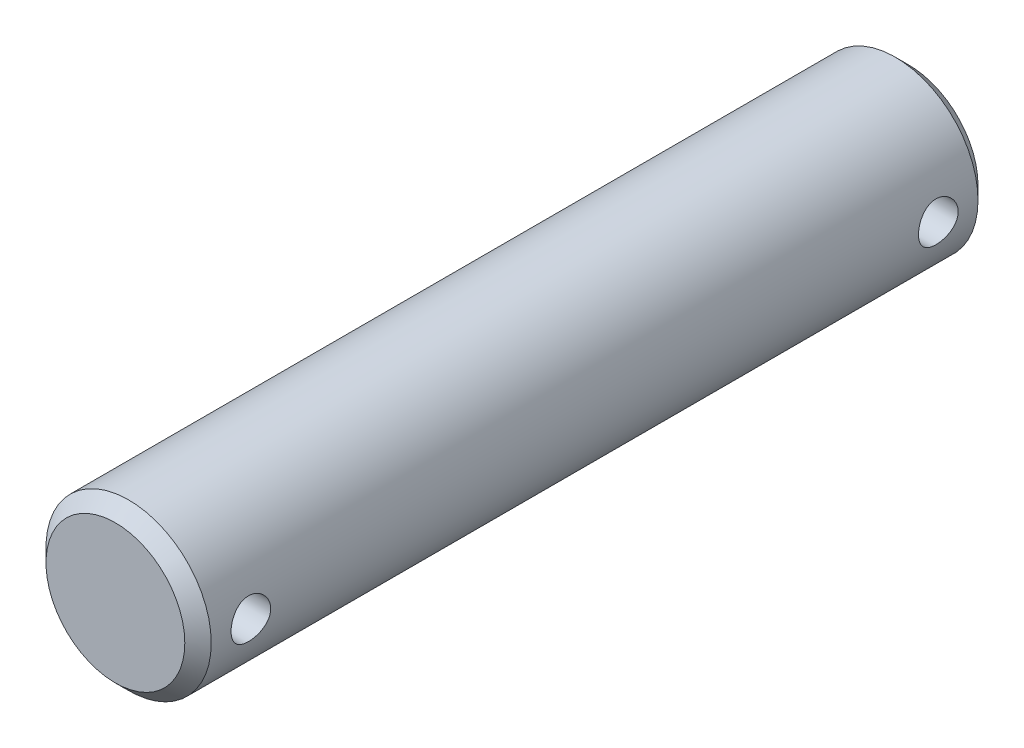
ISO-10303-21;
HEADER;
FILE_DESCRIPTION(('STEP AP214'),'2;1');
FILE_NAME('part.step','',(''),(''),'','','');
FILE_SCHEMA(('AUTOMOTIVE_DESIGN { 1 0 10303 214 1 1 1 1 }'));
ENDSEC;
DATA;
#1=APPLICATION_CONTEXT('core data for automotive mechanical design processes');
#2=APPLICATION_PROTOCOL_DEFINITION('international standard','automotive_design',2000,#1);
#3=PRODUCT_CONTEXT('',#1,'mechanical');
#4=PRODUCT('Part','Part','',(#3));
#5=PRODUCT_RELATED_PRODUCT_CATEGORY('part','',(#4));
#6=PRODUCT_DEFINITION_FORMATION('','',#4);
#7=PRODUCT_DEFINITION_CONTEXT('part definition',#1,'design');
#8=PRODUCT_DEFINITION('design','',#6,#7);
#9=PRODUCT_DEFINITION_SHAPE('','',#8);
#10=(LENGTH_UNIT() NAMED_UNIT(*) SI_UNIT(.MILLI.,.METRE.));
#11=(NAMED_UNIT(*) PLANE_ANGLE_UNIT() SI_UNIT($,.RADIAN.));
#12=(NAMED_UNIT(*) SI_UNIT($,.STERADIAN.) SOLID_ANGLE_UNIT());
#13=UNCERTAINTY_MEASURE_WITH_UNIT(LENGTH_MEASURE(1.E-05),#10,'distance_accuracy_value','');
#14=(GEOMETRIC_REPRESENTATION_CONTEXT(3) GLOBAL_UNCERTAINTY_ASSIGNED_CONTEXT((#13)) GLOBAL_UNIT_ASSIGNED_CONTEXT((#10,
#11,#12)) REPRESENTATION_CONTEXT('',''));
#15=CARTESIAN_POINT('',(0.,0.,0.));
#16=DIRECTION('',(0.,0.,1.));
#17=DIRECTION('',(1.,0.,0.));
#18=AXIS2_PLACEMENT_3D('',#15,#16,#17);
#19=CARTESIAN_POINT('',(0.,0.,120.));
#20=DIRECTION('',(0.,0.,-1.));
#21=DIRECTION('',(-1.,0.,0.));
#22=AXIS2_PLACEMENT_3D('',#19,#20,#21);
#23=CYLINDRICAL_SURFACE('',#22,12.5);
#24=CARTESIAN_POINT('',(-12.5,0.,115.));
#25=CARTESIAN_POINT('',(-12.4999970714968,-0.165963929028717,114.999994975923));
#26=CARTESIAN_POINT('',(-12.4966615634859,-0.331985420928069,114.986181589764));
#27=CARTESIAN_POINT('',(-12.4836783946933,-0.659284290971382,114.931367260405));
#28=CARTESIAN_POINT('',(-12.4740268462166,-0.820558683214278,114.890349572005));
#29=CARTESIAN_POINT('',(-12.4494823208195,-1.13358839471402,114.782507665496));
#30=CARTESIAN_POINT('',(-12.4345953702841,-1.28535442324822,114.715713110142));
#31=CARTESIAN_POINT('',(-12.4011725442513,-1.57552517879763,114.558314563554));
#32=CARTESIAN_POINT('',(-12.3826366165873,-1.71392971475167,114.467710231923));
#33=CARTESIAN_POINT('',(-12.3435386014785,-1.97609263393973,114.263435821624));
#34=CARTESIAN_POINT('',(-12.3229472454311,-2.0995595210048,114.149397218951));
#35=CARTESIAN_POINT('',(-12.2822574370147,-2.32581080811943,113.902281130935));
#36=CARTESIAN_POINT('',(-12.2621590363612,-2.4285930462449,113.769201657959));
#37=CARTESIAN_POINT('',(-12.224437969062,-2.61189993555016,113.485554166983));
#38=CARTESIAN_POINT('',(-12.2068525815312,-2.69210377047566,113.334773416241));
#39=CARTESIAN_POINT('',(-12.1765733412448,-2.82591582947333,113.021380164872));
#40=CARTESIAN_POINT('',(-12.1638787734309,-2.87952794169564,112.858769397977));
#41=CARTESIAN_POINT('',(-12.1451184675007,-2.95765058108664,112.529523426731));
#42=CARTESIAN_POINT('',(-12.1389341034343,-2.98268262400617,112.363018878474));
#43=CARTESIAN_POINT('',(-12.1335389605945,-3.00455808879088,112.028067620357));
#44=CARTESIAN_POINT('',(-12.1343271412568,-3.001405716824,111.859621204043));
#45=CARTESIAN_POINT('',(-12.1426811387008,-2.96741912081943,111.529524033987));
#46=CARTESIAN_POINT('',(-12.1500960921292,-2.93720103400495,111.36780543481));
#47=CARTESIAN_POINT('',(-12.1706283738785,-2.8509214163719,111.051802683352));
#48=CARTESIAN_POINT('',(-12.1837460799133,-2.79485817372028,110.897519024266));
#49=CARTESIAN_POINT('',(-12.2143476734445,-2.65794121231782,110.599087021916));
#50=CARTESIAN_POINT('',(-12.2318714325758,-2.5768594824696,110.455047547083));
#51=CARTESIAN_POINT('',(-12.2692875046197,-2.39236688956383,110.182395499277));
#52=CARTESIAN_POINT('',(-12.2891802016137,-2.28895240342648,110.053785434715));
#53=CARTESIAN_POINT('',(-12.329732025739,-2.05951493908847,109.812106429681));
#54=CARTESIAN_POINT('',(-12.3503975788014,-1.93297064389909,109.699532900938));
#55=CARTESIAN_POINT('',(-12.3896951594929,-1.66255592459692,109.497115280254));
#56=CARTESIAN_POINT('',(-12.4083271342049,-1.51868504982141,109.407271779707));
#57=CARTESIAN_POINT('',(-12.4415394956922,-1.21702847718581,109.252702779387));
#58=CARTESIAN_POINT('',(-12.4561077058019,-1.05920278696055,109.188052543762));
#59=CARTESIAN_POINT('',(-12.4794620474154,-0.73449760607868,109.086334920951));
#60=CARTESIAN_POINT('',(-12.4882491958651,-0.567619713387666,109.049262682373));
#61=CARTESIAN_POINT('',(-12.4989027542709,-0.233787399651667,109.004497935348));
#62=CARTESIAN_POINT('',(-12.5009282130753,-0.0669284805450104,108.996130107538));
#63=CARTESIAN_POINT('',(-12.4982807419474,0.265804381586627,109.007166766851));
#64=CARTESIAN_POINT('',(-12.4936083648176,0.43167840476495,109.026568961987));
#65=CARTESIAN_POINT('',(-12.4781916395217,0.755422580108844,109.092036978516));
#66=CARTESIAN_POINT('',(-12.4675301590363,0.913370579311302,109.137739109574));
#67=CARTESIAN_POINT('',(-12.4413335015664,1.21935330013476,109.254098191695));
#68=CARTESIAN_POINT('',(-12.4257978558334,1.3673870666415,109.324757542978));
#69=CARTESIAN_POINT('',(-12.3911910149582,1.6520615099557,109.490366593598));
#70=CARTESIAN_POINT('',(-12.3720653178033,1.78847176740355,109.585700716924));
#71=CARTESIAN_POINT('',(-12.3324936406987,2.04359904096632,109.797456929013));
#72=CARTESIAN_POINT('',(-12.3120474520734,2.16231325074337,109.913882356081));
#73=CARTESIAN_POINT('',(-12.2715742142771,2.38142453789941,110.167640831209));
#74=CARTESIAN_POINT('',(-12.2515669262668,2.4813497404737,110.305385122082));
#75=CARTESIAN_POINT('',(-12.2147538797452,2.65666020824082,110.596090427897));
#76=CARTESIAN_POINT('',(-12.1979479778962,2.7320465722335,110.749050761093));
#77=CARTESIAN_POINT('',(-12.1696189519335,2.85558993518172,111.065012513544));
#78=CARTESIAN_POINT('',(-12.1580647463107,2.90390754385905,111.227948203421));
#79=CARTESIAN_POINT('',(-12.1415072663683,2.97238380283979,111.559946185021));
#80=CARTESIAN_POINT('',(-12.1365026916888,2.99254804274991,111.729007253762));
#81=CARTESIAN_POINT('',(-12.1337046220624,3.00387066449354,112.063670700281));
#82=CARTESIAN_POINT('',(-12.1357241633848,2.99578106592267,112.229246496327));
#83=CARTESIAN_POINT('',(-12.1463176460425,2.95253345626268,112.556599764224));
#84=CARTESIAN_POINT('',(-12.1548914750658,2.91737590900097,112.718377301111));
#85=CARTESIAN_POINT('',(-12.1775274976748,2.82138591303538,113.032797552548));
#86=CARTESIAN_POINT('',(-12.191561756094,2.76068402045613,113.185482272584));
#87=CARTESIAN_POINT('',(-12.2235433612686,2.61543373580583,113.478604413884));
#88=CARTESIAN_POINT('',(-12.2414912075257,2.53088229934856,113.619040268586));
#89=CARTESIAN_POINT('',(-12.279819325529,2.33793007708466,113.887337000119));
#90=CARTESIAN_POINT('',(-12.3002478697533,2.22900267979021,114.014812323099));
#91=CARTESIAN_POINT('',(-12.3409359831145,1.99143074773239,114.249919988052));
#92=CARTESIAN_POINT('',(-12.361195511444,1.86278158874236,114.35754766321));
#93=CARTESIAN_POINT('',(-12.3996570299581,1.58688299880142,114.551609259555));
#94=CARTESIAN_POINT('',(-12.4178200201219,1.43936414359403,114.637668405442));
#95=CARTESIAN_POINT('',(-12.4496380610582,1.13153622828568,114.783629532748));
#96=CARTESIAN_POINT('',(-12.4632965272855,0.971236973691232,114.843551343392));
#97=CARTESIAN_POINT('',(-12.4824059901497,0.675887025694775,114.926038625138));
#98=CARTESIAN_POINT('',(-12.4889599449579,0.542312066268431,114.953716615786));
#99=CARTESIAN_POINT('',(-12.4977580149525,0.272504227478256,114.990698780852));
#100=CARTESIAN_POINT('',(-12.5000024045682,0.13627151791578,115.000004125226));
#101=CARTESIAN_POINT('',(-12.5,0.,115.));
#102=B_SPLINE_CURVE_WITH_KNOTS('',3,(#24,#25,#26,#27,#28,#29,#30,#31,#32,#33,#34,#35,#36,#37,
#38,#39,#40,#41,#42,#43,#44,#45,#46,#47,#48,#49,#50,#51,#52,#53,#54,#55,#56,#57,#58,#59,#60,#61,
#62,#63,#64,#65,#66,#67,#68,#69,#70,#71,#72,#73,#74,#75,#76,#77,#78,#79,#80,#81,#82,#83,#84,#85,
#86,#87,#88,#89,#90,#91,#92,#93,#94,#95,#96,#97,#98,#99,#100,#101),.UNSPECIFIED.,.T.,.F.,(4,2,2,
2,2,2,2,2,2,2,2,2,2,2,2,2,2,2,2,2,2,2,2,2,2,2,2,2,2,2,2,2,2,2,2,2,2,2,4),(0.,0.497392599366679,
0.995091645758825,1.49221966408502,1.9893547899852,2.49500570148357,3.00070943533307,
3.51327262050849,4.02576083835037,4.52873995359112,5.03164400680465,5.52338274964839,
6.0151540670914,6.51154667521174,7.00801987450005,7.51749958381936,8.02699254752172,
8.53799614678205,9.04890983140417,9.54771776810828,10.0464845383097,10.5385143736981,
11.0305915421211,11.5308523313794,12.0311923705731,12.5427824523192,13.0543496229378,
13.5628484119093,14.0712462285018,14.5662165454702,15.0611783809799,15.5536406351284,
16.0461657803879,16.5505844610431,17.055121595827,17.5678974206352,18.0802835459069,
18.4887142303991,18.8971189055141),.UNSPECIFIED.);
#103=CARTESIAN_POINT('',(-12.5,0.,115.));
#104=VERTEX_POINT('',#103);
#105=EDGE_CURVE('E31',#104,#104,#102,.T.);
#106=ORIENTED_EDGE('',*,*,#105,.T.);
#107=EDGE_LOOP('',(#106));
#108=FACE_BOUND('',#107,.T.);
#109=CARTESIAN_POINT('',(12.5,0.,109.));
#110=CARTESIAN_POINT('',(12.4999970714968,-0.165963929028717,109.000005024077));
#111=CARTESIAN_POINT('',(12.4966615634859,-0.331985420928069,109.013818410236));
#112=CARTESIAN_POINT('',(12.4836783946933,-0.659284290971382,109.068632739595));
#113=CARTESIAN_POINT('',(12.4740268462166,-0.820558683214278,109.109650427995));
#114=CARTESIAN_POINT('',(12.4494823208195,-1.13358839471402,109.217492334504));
#115=CARTESIAN_POINT('',(12.4345953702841,-1.28535442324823,109.284286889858));
#116=CARTESIAN_POINT('',(12.4011725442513,-1.57552517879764,109.441685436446));
#117=CARTESIAN_POINT('',(12.3826366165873,-1.71392971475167,109.532289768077));
#118=CARTESIAN_POINT('',(12.3435386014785,-1.97609263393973,109.736564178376));
#119=CARTESIAN_POINT('',(12.3229472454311,-2.09955952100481,109.850602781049));
#120=CARTESIAN_POINT('',(12.2822574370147,-2.32581080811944,110.097718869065));
#121=CARTESIAN_POINT('',(12.2621590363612,-2.4285930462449,110.230798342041));
#122=CARTESIAN_POINT('',(12.224437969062,-2.61189993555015,110.514445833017));
#123=CARTESIAN_POINT('',(12.2068525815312,-2.69210377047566,110.665226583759));
#124=CARTESIAN_POINT('',(12.1765733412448,-2.82591582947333,110.978619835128));
#125=CARTESIAN_POINT('',(12.1638787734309,-2.87952794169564,111.141230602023));
#126=CARTESIAN_POINT('',(12.1451184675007,-2.95765058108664,111.470476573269));
#127=CARTESIAN_POINT('',(12.1389341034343,-2.98268262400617,111.636981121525));
#128=CARTESIAN_POINT('',(12.1335389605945,-3.00455808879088,111.971932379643));
#129=CARTESIAN_POINT('',(12.1343271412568,-3.001405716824,112.140378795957));
#130=CARTESIAN_POINT('',(12.1426811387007,-2.96741912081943,112.470475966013));
#131=CARTESIAN_POINT('',(12.1500960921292,-2.93720103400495,112.63219456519));
#132=CARTESIAN_POINT('',(12.1706283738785,-2.85092141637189,112.948197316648));
#133=CARTESIAN_POINT('',(12.1837460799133,-2.79485817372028,113.102480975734));
#134=CARTESIAN_POINT('',(12.2143476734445,-2.65794121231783,113.400912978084));
#135=CARTESIAN_POINT('',(12.2318714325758,-2.57685948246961,113.544952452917));
#136=CARTESIAN_POINT('',(12.2692875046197,-2.39236688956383,113.817604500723));
#137=CARTESIAN_POINT('',(12.2891802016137,-2.28895240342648,113.946214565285));
#138=CARTESIAN_POINT('',(12.329732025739,-2.05951493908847,114.187893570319));
#139=CARTESIAN_POINT('',(12.3503975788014,-1.93297064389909,114.300467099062));
#140=CARTESIAN_POINT('',(12.3896951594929,-1.66255592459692,114.502884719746));
#141=CARTESIAN_POINT('',(12.4083271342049,-1.51868504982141,114.592728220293));
#142=CARTESIAN_POINT('',(12.4415394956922,-1.21702847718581,114.747297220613));
#143=CARTESIAN_POINT('',(12.4561077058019,-1.05920278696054,114.811947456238));
#144=CARTESIAN_POINT('',(12.4794620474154,-0.734497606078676,114.913665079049));
#145=CARTESIAN_POINT('',(12.4882491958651,-0.567619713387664,114.950737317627));
#146=CARTESIAN_POINT('',(12.4989027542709,-0.233787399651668,114.995502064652));
#147=CARTESIAN_POINT('',(12.5009282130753,-0.0669284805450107,115.003869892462));
#148=CARTESIAN_POINT('',(12.4982807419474,0.265804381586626,114.992833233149));
#149=CARTESIAN_POINT('',(12.4936083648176,0.43167840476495,114.973431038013));
#150=CARTESIAN_POINT('',(12.4781916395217,0.755422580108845,114.907963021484));
#151=CARTESIAN_POINT('',(12.4675301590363,0.913370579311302,114.862260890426));
#152=CARTESIAN_POINT('',(12.4413335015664,1.21935330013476,114.745901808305));
#153=CARTESIAN_POINT('',(12.4257978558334,1.3673870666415,114.675242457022));
#154=CARTESIAN_POINT('',(12.3911910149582,1.6520615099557,114.509633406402));
#155=CARTESIAN_POINT('',(12.3720653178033,1.78847176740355,114.414299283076));
#156=CARTESIAN_POINT('',(12.3324936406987,2.04359904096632,114.202543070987));
#157=CARTESIAN_POINT('',(12.3120474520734,2.16231325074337,114.086117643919));
#158=CARTESIAN_POINT('',(12.2715742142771,2.38142453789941,113.832359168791));
#159=CARTESIAN_POINT('',(12.2515669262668,2.48134974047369,113.694614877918));
#160=CARTESIAN_POINT('',(12.2147538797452,2.65666020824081,113.403909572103));
#161=CARTESIAN_POINT('',(12.1979479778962,2.7320465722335,113.250949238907));
#162=CARTESIAN_POINT('',(12.1696189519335,2.85558993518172,112.934987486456));
#163=CARTESIAN_POINT('',(12.1580647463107,2.90390754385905,112.772051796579));
#164=CARTESIAN_POINT('',(12.1415072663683,2.97238380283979,112.440053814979));
#165=CARTESIAN_POINT('',(12.1365026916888,2.99254804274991,112.270992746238));
#166=CARTESIAN_POINT('',(12.1337046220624,3.00387066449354,111.936329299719));
#167=CARTESIAN_POINT('',(12.1357241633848,2.99578106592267,111.770753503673));
#168=CARTESIAN_POINT('',(12.1463176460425,2.95253345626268,111.443400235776));
#169=CARTESIAN_POINT('',(12.1548914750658,2.91737590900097,111.281622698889));
#170=CARTESIAN_POINT('',(12.1775274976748,2.82138591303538,110.967202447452));
#171=CARTESIAN_POINT('',(12.191561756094,2.76068402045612,110.814517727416));
#172=CARTESIAN_POINT('',(12.2235433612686,2.61543373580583,110.521395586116));
#173=CARTESIAN_POINT('',(12.2414912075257,2.53088229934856,110.380959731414));
#174=CARTESIAN_POINT('',(12.279819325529,2.33793007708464,110.11266299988));
#175=CARTESIAN_POINT('',(12.3002478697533,2.22900267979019,109.985187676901));
#176=CARTESIAN_POINT('',(12.3409359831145,1.99143074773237,109.750080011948));
#177=CARTESIAN_POINT('',(12.361195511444,1.86278158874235,109.64245233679));
#178=CARTESIAN_POINT('',(12.3996570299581,1.58688299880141,109.448390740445));
#179=CARTESIAN_POINT('',(12.4178200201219,1.43936414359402,109.362331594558));
#180=CARTESIAN_POINT('',(12.4496380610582,1.13153622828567,109.216370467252));
#181=CARTESIAN_POINT('',(12.4632965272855,0.971236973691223,109.156448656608));
#182=CARTESIAN_POINT('',(12.4824059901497,0.675887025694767,109.073961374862));
#183=CARTESIAN_POINT('',(12.4889599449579,0.542312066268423,109.046283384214));
#184=CARTESIAN_POINT('',(12.4977580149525,0.272504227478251,109.009301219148));
#185=CARTESIAN_POINT('',(12.5000024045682,0.136271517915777,108.999995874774));
#186=CARTESIAN_POINT('',(12.5,0.,109.));
#187=B_SPLINE_CURVE_WITH_KNOTS('',3,(#109,#110,#111,#112,#113,#114,#115,#116,#117,#118,#119,
#120,#121,#122,#123,#124,#125,#126,#127,#128,#129,#130,#131,#132,#133,#134,#135,#136,#137,#138,
#139,#140,#141,#142,#143,#144,#145,#146,#147,#148,#149,#150,#151,#152,#153,#154,#155,#156,#157,
#158,#159,#160,#161,#162,#163,#164,#165,#166,#167,#168,#169,#170,#171,#172,#173,#174,#175,#176,
#177,#178,#179,#180,#181,#182,#183,#184,#185,#186),.UNSPECIFIED.,.T.,.F.,(4,2,2,2,2,2,2,2,2,2,2,
2,2,2,2,2,2,2,2,2,2,2,2,2,2,2,2,2,2,2,2,2,2,2,2,2,2,2,4),(0.,0.497392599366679,
0.995091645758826,1.49221966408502,1.9893547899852,2.49500570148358,3.00070943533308,
3.51327262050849,4.02576083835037,4.52873995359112,5.03164400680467,5.5233827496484,
6.0151540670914,6.51154667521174,7.00801987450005,7.51749958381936,8.02699254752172,
8.53799614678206,9.04890983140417,9.54771776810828,10.0464845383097,10.5385143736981,
11.0305915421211,11.5308523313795,12.0311923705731,12.5427824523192,13.0543496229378,
13.5628484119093,14.0712462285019,14.5662165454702,15.06117838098,15.5536406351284,
16.0461657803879,16.5505844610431,17.055121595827,17.5678974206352,18.0802835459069,
18.4887142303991,18.8971189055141),.UNSPECIFIED.);
#188=CARTESIAN_POINT('',(12.5,0.,109.));
#189=VERTEX_POINT('',#188);
#190=EDGE_CURVE('E89',#189,#189,#187,.T.);
#191=ORIENTED_EDGE('',*,*,#190,.T.);
#192=EDGE_LOOP('',(#191));
#193=FACE_BOUND('',#192,.T.);
#194=CARTESIAN_POINT('',(-12.5,0.,11.));
#195=CARTESIAN_POINT('',(-12.4999970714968,-0.165963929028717,10.9999949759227));
#196=CARTESIAN_POINT('',(-12.4966615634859,-0.331985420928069,10.9861815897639));
#197=CARTESIAN_POINT('',(-12.4836783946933,-0.659284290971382,10.9313672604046));
#198=CARTESIAN_POINT('',(-12.4740268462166,-0.820558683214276,10.8903495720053));
#199=CARTESIAN_POINT('',(-12.4494823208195,-1.13358839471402,10.7825076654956));
#200=CARTESIAN_POINT('',(-12.4345953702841,-1.28535442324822,10.7157131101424));
#201=CARTESIAN_POINT('',(-12.4011725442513,-1.57552517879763,10.5583145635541));
#202=CARTESIAN_POINT('',(-12.3826366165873,-1.71392971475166,10.4677102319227));
#203=CARTESIAN_POINT('',(-12.3435386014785,-1.97609263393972,10.2634358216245));
#204=CARTESIAN_POINT('',(-12.3229472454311,-2.0995595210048,10.1493972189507));
#205=CARTESIAN_POINT('',(-12.2822574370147,-2.32581080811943,9.90228113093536));
#206=CARTESIAN_POINT('',(-12.2621590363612,-2.42859304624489,9.76920165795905));
#207=CARTESIAN_POINT('',(-12.224437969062,-2.61189993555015,9.48555416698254));
#208=CARTESIAN_POINT('',(-12.2068525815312,-2.69210377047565,9.33477341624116));
#209=CARTESIAN_POINT('',(-12.1765733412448,-2.82591582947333,9.02138016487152));
#210=CARTESIAN_POINT('',(-12.1638787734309,-2.87952794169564,8.85876939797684));
#211=CARTESIAN_POINT('',(-12.1451184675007,-2.95765058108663,8.5295234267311));
#212=CARTESIAN_POINT('',(-12.1389341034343,-2.98268262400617,8.3630188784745));
#213=CARTESIAN_POINT('',(-12.1335389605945,-3.00455808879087,8.02806762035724));
#214=CARTESIAN_POINT('',(-12.1343271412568,-3.00140571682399,7.85962120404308));
#215=CARTESIAN_POINT('',(-12.1426811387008,-2.96741912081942,7.52952403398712));
#216=CARTESIAN_POINT('',(-12.1500960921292,-2.93720103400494,7.36780543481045));
#217=CARTESIAN_POINT('',(-12.1706283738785,-2.85092141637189,7.05180268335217));
#218=CARTESIAN_POINT('',(-12.1837460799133,-2.79485817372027,6.89751902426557));
#219=CARTESIAN_POINT('',(-12.2143476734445,-2.65794121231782,6.59908702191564));
#220=CARTESIAN_POINT('',(-12.2318714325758,-2.5768594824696,6.45504754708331));
#221=CARTESIAN_POINT('',(-12.2692875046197,-2.39236688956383,6.18239549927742));
#222=CARTESIAN_POINT('',(-12.2891802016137,-2.28895240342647,6.05378543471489));
#223=CARTESIAN_POINT('',(-12.329732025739,-2.05951493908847,5.81210642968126));
#224=CARTESIAN_POINT('',(-12.3503975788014,-1.93297064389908,5.69953290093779));
#225=CARTESIAN_POINT('',(-12.3896951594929,-1.66255592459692,5.49711528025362));
#226=CARTESIAN_POINT('',(-12.4083271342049,-1.51868504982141,5.40727177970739));
#227=CARTESIAN_POINT('',(-12.4415394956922,-1.21702847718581,5.25270277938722));
#228=CARTESIAN_POINT('',(-12.4561077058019,-1.05920278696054,5.18805254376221));
#229=CARTESIAN_POINT('',(-12.4794620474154,-0.734497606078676,5.08633492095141));
#230=CARTESIAN_POINT('',(-12.4882491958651,-0.567619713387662,5.04926268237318));
#231=CARTESIAN_POINT('',(-12.4989027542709,-0.233787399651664,5.00449793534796));
#232=CARTESIAN_POINT('',(-12.5009282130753,-0.0669284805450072,4.99613010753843));
#233=CARTESIAN_POINT('',(-12.4982807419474,0.26580438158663,5.0071667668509));
#234=CARTESIAN_POINT('',(-12.4936083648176,0.431678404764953,5.02656896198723));
#235=CARTESIAN_POINT('',(-12.4781916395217,0.755422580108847,5.09203697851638));
#236=CARTESIAN_POINT('',(-12.4675301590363,0.913370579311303,5.1377391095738));
#237=CARTESIAN_POINT('',(-12.4413335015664,1.21935330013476,5.25409819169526));
#238=CARTESIAN_POINT('',(-12.4257978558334,1.3673870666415,5.3247575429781));
#239=CARTESIAN_POINT('',(-12.3911910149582,1.6520615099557,5.49036659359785));
#240=CARTESIAN_POINT('',(-12.3720653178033,1.78847176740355,5.58570071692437));
#241=CARTESIAN_POINT('',(-12.3324936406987,2.04359904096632,5.79745692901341));
#242=CARTESIAN_POINT('',(-12.3120474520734,2.16231325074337,5.91388235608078));
#243=CARTESIAN_POINT('',(-12.2715742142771,2.38142453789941,6.16764083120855));
#244=CARTESIAN_POINT('',(-12.2515669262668,2.4813497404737,6.3053851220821));
#245=CARTESIAN_POINT('',(-12.2147538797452,2.65666020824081,6.59609042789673));
#246=CARTESIAN_POINT('',(-12.1979479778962,2.7320465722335,6.74905076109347));
#247=CARTESIAN_POINT('',(-12.1696189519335,2.85558993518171,7.06501251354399));
#248=CARTESIAN_POINT('',(-12.1580647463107,2.90390754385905,7.22794820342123));
#249=CARTESIAN_POINT('',(-12.1415072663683,2.97238380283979,7.55994618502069));
#250=CARTESIAN_POINT('',(-12.1365026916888,2.99254804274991,7.72900725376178));
#251=CARTESIAN_POINT('',(-12.1337046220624,3.00387066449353,8.0636707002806));
#252=CARTESIAN_POINT('',(-12.1357241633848,2.99578106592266,8.2292464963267));
#253=CARTESIAN_POINT('',(-12.1463176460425,2.95253345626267,8.55659976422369));
#254=CARTESIAN_POINT('',(-12.1548914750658,2.91737590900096,8.71837730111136));
#255=CARTESIAN_POINT('',(-12.1775274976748,2.82138591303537,9.03279755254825));
#256=CARTESIAN_POINT('',(-12.191561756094,2.76068402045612,9.18548227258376));
#257=CARTESIAN_POINT('',(-12.2235433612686,2.61543373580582,9.47860441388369));
#258=CARTESIAN_POINT('',(-12.2414912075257,2.53088229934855,9.61904026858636));
#259=CARTESIAN_POINT('',(-12.279819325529,2.33793007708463,9.88733700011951));
#260=CARTESIAN_POINT('',(-12.3002478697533,2.22900267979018,10.0148123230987));
#261=CARTESIAN_POINT('',(-12.3409359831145,1.99143074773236,10.2499199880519));
#262=CARTESIAN_POINT('',(-12.361195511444,1.86278158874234,10.3575476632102));
#263=CARTESIAN_POINT('',(-12.3996570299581,1.5868829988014,10.5516092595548));
#264=CARTESIAN_POINT('',(-12.4178200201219,1.43936414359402,10.637668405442));
#265=CARTESIAN_POINT('',(-12.4496380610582,1.13153622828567,10.7836295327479));
#266=CARTESIAN_POINT('',(-12.4632965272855,0.97123697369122,10.8435513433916));
#267=CARTESIAN_POINT('',(-12.4824059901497,0.675887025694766,10.9260386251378));
#268=CARTESIAN_POINT('',(-12.4889599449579,0.542312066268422,10.9537166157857));
#269=CARTESIAN_POINT('',(-12.4977580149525,0.272504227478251,10.9906987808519));
#270=CARTESIAN_POINT('',(-12.5000024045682,0.136271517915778,11.0000041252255));
#271=CARTESIAN_POINT('',(-12.5,0.,11.));
#272=B_SPLINE_CURVE_WITH_KNOTS('',3,(#194,#195,#196,#197,#198,#199,#200,#201,#202,#203,#204,
#205,#206,#207,#208,#209,#210,#211,#212,#213,#214,#215,#216,#217,#218,#219,#220,#221,#222,#223,
#224,#225,#226,#227,#228,#229,#230,#231,#232,#233,#234,#235,#236,#237,#238,#239,#240,#241,#242,
#243,#244,#245,#246,#247,#248,#249,#250,#251,#252,#253,#254,#255,#256,#257,#258,#259,#260,#261,
#262,#263,#264,#265,#266,#267,#268,#269,#270,#271),.UNSPECIFIED.,.T.,.F.,(4,2,2,2,2,2,2,2,2,2,2,
2,2,2,2,2,2,2,2,2,2,2,2,2,2,2,2,2,2,2,2,2,2,2,2,2,2,2,4),(0.,0.497392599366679,
0.995091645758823,1.49221966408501,1.98935478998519,2.49500570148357,3.00070943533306,
3.51327262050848,4.02576083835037,4.52873995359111,5.03164400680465,5.52338274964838,
6.01515406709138,6.51154667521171,7.00801987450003,7.51749958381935,8.02699254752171,
8.53799614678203,9.04890983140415,9.54771776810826,10.0464845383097,10.5385143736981,
11.0305915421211,11.5308523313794,12.031192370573,12.5427824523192,13.0543496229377,
13.5628484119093,14.0712462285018,14.5662165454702,15.0611783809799,15.5536406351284,
16.0461657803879,16.5505844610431,17.0551215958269,17.5678974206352,18.0802835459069,
18.4887142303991,18.897118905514),.UNSPECIFIED.);
#273=CARTESIAN_POINT('',(-12.5,0.,11.));
#274=VERTEX_POINT('',#273);
#275=EDGE_CURVE('E53',#274,#274,#272,.T.);
#276=ORIENTED_EDGE('',*,*,#275,.T.);
#277=EDGE_LOOP('',(#276));
#278=FACE_BOUND('',#277,.T.);
#279=CARTESIAN_POINT('',(12.5,0.,5.));
#280=CARTESIAN_POINT('',(12.4999970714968,-0.165963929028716,5.00000502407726));
#281=CARTESIAN_POINT('',(12.4966615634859,-0.331985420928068,5.01381841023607));
#282=CARTESIAN_POINT('',(12.4836783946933,-0.659284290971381,5.06863273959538));
#283=CARTESIAN_POINT('',(12.4740268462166,-0.820558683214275,5.10965042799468));
#284=CARTESIAN_POINT('',(12.4494823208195,-1.13358839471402,5.21749233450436));
#285=CARTESIAN_POINT('',(12.4345953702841,-1.28535442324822,5.28428688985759));
#286=CARTESIAN_POINT('',(12.4011725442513,-1.57552517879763,5.44168543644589));
#287=CARTESIAN_POINT('',(12.3826366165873,-1.71392971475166,5.53228976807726));
#288=CARTESIAN_POINT('',(12.3435386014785,-1.97609263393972,5.73656417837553));
#289=CARTESIAN_POINT('',(12.3229472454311,-2.0995595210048,5.85060278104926));
#290=CARTESIAN_POINT('',(12.2822574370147,-2.32581080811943,6.09771886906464));
#291=CARTESIAN_POINT('',(12.2621590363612,-2.42859304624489,6.23079834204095));
#292=CARTESIAN_POINT('',(12.224437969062,-2.61189993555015,6.51444583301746));
#293=CARTESIAN_POINT('',(12.2068525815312,-2.69210377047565,6.66522658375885));
#294=CARTESIAN_POINT('',(12.1765733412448,-2.82591582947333,6.97861983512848));
#295=CARTESIAN_POINT('',(12.1638787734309,-2.87952794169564,7.14123060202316));
#296=CARTESIAN_POINT('',(12.1451184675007,-2.95765058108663,7.4704765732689));
#297=CARTESIAN_POINT('',(12.1389341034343,-2.98268262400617,7.63698112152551));
#298=CARTESIAN_POINT('',(12.1335389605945,-3.00455808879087,7.97193237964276));
#299=CARTESIAN_POINT('',(12.1343271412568,-3.00140571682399,8.14037879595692));
#300=CARTESIAN_POINT('',(12.1426811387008,-2.96741912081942,8.47047596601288));
#301=CARTESIAN_POINT('',(12.1500960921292,-2.93720103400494,8.63219456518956));
#302=CARTESIAN_POINT('',(12.1706283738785,-2.85092141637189,8.94819731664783));
#303=CARTESIAN_POINT('',(12.1837460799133,-2.79485817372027,9.10248097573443));
#304=CARTESIAN_POINT('',(12.2143476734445,-2.65794121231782,9.40091297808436));
#305=CARTESIAN_POINT('',(12.2318714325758,-2.5768594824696,9.54495245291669));
#306=CARTESIAN_POINT('',(12.2692875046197,-2.39236688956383,9.81760450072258));
#307=CARTESIAN_POINT('',(12.2891802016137,-2.28895240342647,9.94621456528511));
#308=CARTESIAN_POINT('',(12.329732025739,-2.05951493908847,10.1878935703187));
#309=CARTESIAN_POINT('',(12.3503975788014,-1.93297064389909,10.3004670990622));
#310=CARTESIAN_POINT('',(12.3896951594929,-1.66255592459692,10.5028847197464));
#311=CARTESIAN_POINT('',(12.4083271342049,-1.51868504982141,10.5927282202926));
#312=CARTESIAN_POINT('',(12.4415394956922,-1.21702847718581,10.7472972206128));
#313=CARTESIAN_POINT('',(12.4561077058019,-1.05920278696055,10.8119474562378));
#314=CARTESIAN_POINT('',(12.4794620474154,-0.734497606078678,10.9136650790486));
#315=CARTESIAN_POINT('',(12.4882491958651,-0.567619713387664,10.9507373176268));
#316=CARTESIAN_POINT('',(12.4989027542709,-0.233787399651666,10.995502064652));
#317=CARTESIAN_POINT('',(12.5009282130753,-0.0669284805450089,11.0038698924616));
#318=CARTESIAN_POINT('',(12.4982807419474,0.265804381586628,10.9928332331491));
#319=CARTESIAN_POINT('',(12.4936083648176,0.431678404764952,10.9734310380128));
#320=CARTESIAN_POINT('',(12.4781916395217,0.755422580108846,10.9079630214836));
#321=CARTESIAN_POINT('',(12.4675301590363,0.913370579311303,10.8622608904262));
#322=CARTESIAN_POINT('',(12.4413335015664,1.21935330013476,10.7459018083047));
#323=CARTESIAN_POINT('',(12.4257978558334,1.3673870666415,10.6752424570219));
#324=CARTESIAN_POINT('',(12.3911910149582,1.6520615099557,10.5096334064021));
#325=CARTESIAN_POINT('',(12.3720653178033,1.78847176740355,10.4142992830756));
#326=CARTESIAN_POINT('',(12.3324936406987,2.04359904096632,10.2025430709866));
#327=CARTESIAN_POINT('',(12.3120474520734,2.16231325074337,10.0861176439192));
#328=CARTESIAN_POINT('',(12.2715742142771,2.38142453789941,9.83235916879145));
#329=CARTESIAN_POINT('',(12.2515669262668,2.4813497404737,9.6946148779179));
#330=CARTESIAN_POINT('',(12.2147538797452,2.65666020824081,9.40390957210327));
#331=CARTESIAN_POINT('',(12.1979479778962,2.7320465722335,9.25094923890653));
#332=CARTESIAN_POINT('',(12.1696189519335,2.85558993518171,8.93498748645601));
#333=CARTESIAN_POINT('',(12.1580647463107,2.90390754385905,8.77205179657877));
#334=CARTESIAN_POINT('',(12.1415072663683,2.97238380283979,8.44005381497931));
#335=CARTESIAN_POINT('',(12.1365026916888,2.99254804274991,8.27099274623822));
#336=CARTESIAN_POINT('',(12.1337046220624,3.00387066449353,7.9363292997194));
#337=CARTESIAN_POINT('',(12.1357241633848,2.99578106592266,7.7707535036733));
#338=CARTESIAN_POINT('',(12.1463176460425,2.95253345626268,7.44340023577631));
#339=CARTESIAN_POINT('',(12.1548914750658,2.91737590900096,7.28162269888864));
#340=CARTESIAN_POINT('',(12.1775274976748,2.82138591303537,6.96720244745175));
#341=CARTESIAN_POINT('',(12.191561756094,2.76068402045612,6.81451772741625));
#342=CARTESIAN_POINT('',(12.2235433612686,2.61543373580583,6.52139558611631));
#343=CARTESIAN_POINT('',(12.2414912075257,2.53088229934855,6.38095973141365));
#344=CARTESIAN_POINT('',(12.279819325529,2.33793007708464,6.11266299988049));
#345=CARTESIAN_POINT('',(12.3002478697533,2.22900267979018,5.98518767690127));
#346=CARTESIAN_POINT('',(12.3409359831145,1.99143074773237,5.75008001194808));
#347=CARTESIAN_POINT('',(12.361195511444,1.86278158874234,5.64245233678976));
#348=CARTESIAN_POINT('',(12.3996570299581,1.5868829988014,5.44839074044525));
#349=CARTESIAN_POINT('',(12.4178200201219,1.43936414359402,5.362331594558));
#350=CARTESIAN_POINT('',(12.4496380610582,1.13153622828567,5.21637046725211));
#351=CARTESIAN_POINT('',(12.4632965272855,0.971236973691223,5.15644865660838));
#352=CARTESIAN_POINT('',(12.4824059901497,0.675887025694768,5.07396137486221));
#353=CARTESIAN_POINT('',(12.4889599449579,0.542312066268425,5.0462833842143));
#354=CARTESIAN_POINT('',(12.4977580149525,0.272504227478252,5.00930121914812));
#355=CARTESIAN_POINT('',(12.5000024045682,0.136271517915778,4.99999587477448));
#356=CARTESIAN_POINT('',(12.5,0.,5.));
#357=B_SPLINE_CURVE_WITH_KNOTS('',3,(#279,#280,#281,#282,#283,#284,#285,#286,#287,#288,#289,
#290,#291,#292,#293,#294,#295,#296,#297,#298,#299,#300,#301,#302,#303,#304,#305,#306,#307,#308,
#309,#310,#311,#312,#313,#314,#315,#316,#317,#318,#319,#320,#321,#322,#323,#324,#325,#326,#327,
#328,#329,#330,#331,#332,#333,#334,#335,#336,#337,#338,#339,#340,#341,#342,#343,#344,#345,#346,
#347,#348,#349,#350,#351,#352,#353,#354,#355,#356),.UNSPECIFIED.,.T.,.F.,(4,2,2,2,2,2,2,2,2,2,2,
2,2,2,2,2,2,2,2,2,2,2,2,2,2,2,2,2,2,2,2,2,2,2,2,2,2,2,4),(0.,0.497392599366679,
0.995091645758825,1.49221966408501,1.98935478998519,2.49500570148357,3.00070943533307,
3.51327262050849,4.02576083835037,4.52873995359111,5.03164400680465,5.52338274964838,
6.01515406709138,6.51154667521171,7.00801987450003,7.51749958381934,8.0269925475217,
8.53799614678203,9.04890983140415,9.54771776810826,10.0464845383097,10.5385143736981,
11.0305915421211,11.5308523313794,12.031192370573,12.5427824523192,13.0543496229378,
13.5628484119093,14.0712462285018,14.5662165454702,15.0611783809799,15.5536406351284,
16.0461657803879,16.5505844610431,17.0551215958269,17.5678974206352,18.0802835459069,
18.4887142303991,18.897118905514),.UNSPECIFIED.);
#358=CARTESIAN_POINT('',(12.5,0.,5.));
#359=VERTEX_POINT('',#358);
#360=EDGE_CURVE('E47',#359,#359,#357,.T.);
#361=ORIENTED_EDGE('',*,*,#360,.T.);
#362=EDGE_LOOP('',(#361));
#363=FACE_BOUND('',#362,.T.);
#364=CARTESIAN_POINT('',(0.,0.,2.));
#365=DIRECTION('',(0.,0.,1.));
#366=DIRECTION('',(1.,0.,0.));
#367=AXIS2_PLACEMENT_3D('',#364,#365,#366);
#368=CIRCLE('',#367,12.5);
#369=CARTESIAN_POINT('',(12.5,0.,2.));
#370=VERTEX_POINT('',#369);
#371=EDGE_CURVE('E43',#370,#370,#368,.T.);
#372=ORIENTED_EDGE('',*,*,#371,.T.);
#373=EDGE_LOOP('',(#372));
#374=FACE_BOUND('',#373,.T.);
#375=CARTESIAN_POINT('',(0.,0.,118.));
#376=DIRECTION('',(0.,0.,1.));
#377=DIRECTION('',(1.,0.,0.));
#378=AXIS2_PLACEMENT_3D('',#375,#376,#377);
#379=CIRCLE('',#378,12.5);
#380=CARTESIAN_POINT('',(12.5,0.,118.));
#381=VERTEX_POINT('',#380);
#382=EDGE_CURVE('E100',#381,#381,#379,.F.);
#383=ORIENTED_EDGE('',*,*,#382,.T.);
#384=EDGE_LOOP('',(#383));
#385=FACE_BOUND('',#384,.T.);
#386=ADVANCED_FACE('F27',(#108,#193,#278,#363,#374,#385),#23,.T.);
#387=CARTESIAN_POINT('',(0.,0.,120.));
#388=DIRECTION('',(0.,0.,1.));
#389=DIRECTION('',(1.,0.,0.));
#390=AXIS2_PLACEMENT_3D('',#387,#388,#389);
#391=PLANE('',#390);
#392=CARTESIAN_POINT('',(0.,0.,120.));
#393=DIRECTION('',(0.,0.,1.));
#394=DIRECTION('',(1.,0.,0.));
#395=AXIS2_PLACEMENT_3D('',#392,#393,#394);
#396=CIRCLE('',#395,10.5);
#397=CARTESIAN_POINT('',(10.5,0.,120.));
#398=VERTEX_POINT('',#397);
#399=EDGE_CURVE('E10',#398,#398,#396,.T.);
#400=ORIENTED_EDGE('',*,*,#399,.T.);
#401=EDGE_LOOP('',(#400));
#402=FACE_BOUND('',#401,.T.);
#403=ADVANCED_FACE('F74',(#402),#391,.T.);
#404=CARTESIAN_POINT('',(0.,0.,0.));
#405=DIRECTION('',(0.,0.,1.));
#406=DIRECTION('',(1.,0.,0.));
#407=AXIS2_PLACEMENT_3D('',#404,#405,#406);
#408=PLANE('',#407);
#409=CARTESIAN_POINT('',(0.,0.,0.));
#410=DIRECTION('',(0.,0.,1.));
#411=DIRECTION('',(1.,0.,0.));
#412=AXIS2_PLACEMENT_3D('',#409,#410,#411);
#413=CIRCLE('',#412,10.5);
#414=CARTESIAN_POINT('',(10.5,0.,0.));
#415=VERTEX_POINT('',#414);
#416=EDGE_CURVE('E38',#415,#415,#413,.F.);
#417=ORIENTED_EDGE('',*,*,#416,.T.);
#418=EDGE_LOOP('',(#417));
#419=FACE_BOUND('',#418,.T.);
#420=ADVANCED_FACE('F71',(#419),#408,.F.);
#421=CARTESIAN_POINT('',(0.,0.,2.));
#422=DIRECTION('',(0.,0.,1.));
#423=DIRECTION('',(1.,0.,0.));
#424=AXIS2_PLACEMENT_3D('',#421,#422,#423);
#425=CONICAL_SURFACE('',#424,12.5,0.785398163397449);
#426=ORIENTED_EDGE('',*,*,#416,.F.);
#427=EDGE_LOOP('',(#426));
#428=FACE_BOUND('',#427,.T.);
#429=ORIENTED_EDGE('',*,*,#371,.F.);
#430=EDGE_LOOP('',(#429));
#431=FACE_BOUND('',#430,.T.);
#432=ADVANCED_FACE('F67',(#428,#431),#425,.T.);
#433=CARTESIAN_POINT('',(0.,0.,120.));
#434=DIRECTION('',(0.,0.,-1.));
#435=DIRECTION('',(-1.,0.,0.));
#436=AXIS2_PLACEMENT_3D('',#433,#434,#435);
#437=CONICAL_SURFACE('',#436,10.5,0.785398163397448);
#438=ORIENTED_EDGE('',*,*,#382,.F.);
#439=EDGE_LOOP('',(#438));
#440=FACE_BOUND('',#439,.T.);
#441=ORIENTED_EDGE('',*,*,#399,.F.);
#442=EDGE_LOOP('',(#441));
#443=FACE_BOUND('',#442,.T.);
#444=ADVANCED_FACE('F61',(#440,#443),#437,.T.);
#445=CARTESIAN_POINT('',(-14.,0.,8.));
#446=DIRECTION('',(1.,0.,0.));
#447=DIRECTION('',(0.,0.,-1.));
#448=AXIS2_PLACEMENT_3D('',#445,#446,#447);
#449=CYLINDRICAL_SURFACE('',#448,3.);
#450=ORIENTED_EDGE('',*,*,#360,.F.);
#451=EDGE_LOOP('',(#450));
#452=FACE_BOUND('',#451,.T.);
#453=ORIENTED_EDGE('',*,*,#275,.F.);
#454=EDGE_LOOP('',(#453));
#455=FACE_BOUND('',#454,.T.);
#456=ADVANCED_FACE('F56',(#452,#455),#449,.F.);
#457=CARTESIAN_POINT('',(-14.,0.,112.));
#458=DIRECTION('',(1.,0.,0.));
#459=DIRECTION('',(0.,0.,-1.));
#460=AXIS2_PLACEMENT_3D('',#457,#458,#459);
#461=CYLINDRICAL_SURFACE('',#460,3.00000000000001);
#462=ORIENTED_EDGE('',*,*,#190,.F.);
#463=EDGE_LOOP('',(#462));
#464=FACE_BOUND('',#463,.T.);
#465=ORIENTED_EDGE('',*,*,#105,.F.);
#466=EDGE_LOOP('',(#465));
#467=FACE_BOUND('',#466,.T.);
#468=ADVANCED_FACE('F60',(#464,#467),#461,.F.);
#469=CLOSED_SHELL('',(#386,#403,#420,#432,#444,#456,#468));
#470=MANIFOLD_SOLID_BREP('B2',#469);
#471=ADVANCED_BREP_SHAPE_REPRESENTATION('',(#18,#470),#14);
#472=SHAPE_DEFINITION_REPRESENTATION(#9,#471);
ENDSEC;
END-ISO-10303-21;
